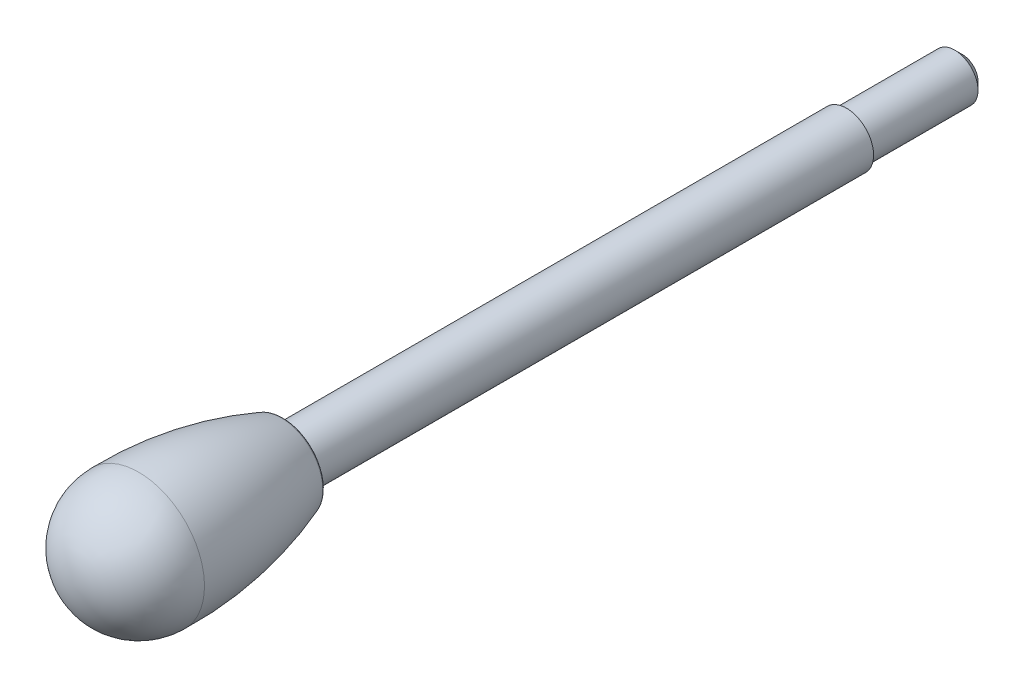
ISO-10303-21;
HEADER;
FILE_DESCRIPTION(('STEP AP214'),'2;1');
FILE_NAME('part.step','',(''),(''),'','','');
FILE_SCHEMA(('AUTOMOTIVE_DESIGN { 1 0 10303 214 1 1 1 1 }'));
ENDSEC;
DATA;
#1=APPLICATION_CONTEXT('core data for automotive mechanical design processes');
#2=APPLICATION_PROTOCOL_DEFINITION('international standard','automotive_design',2000,#1);
#3=PRODUCT_CONTEXT('',#1,'mechanical');
#4=PRODUCT('Part','Part','',(#3));
#5=PRODUCT_RELATED_PRODUCT_CATEGORY('part','',(#4));
#6=PRODUCT_DEFINITION_FORMATION('','',#4);
#7=PRODUCT_DEFINITION_CONTEXT('part definition',#1,'design');
#8=PRODUCT_DEFINITION('design','',#6,#7);
#9=PRODUCT_DEFINITION_SHAPE('','',#8);
#10=(LENGTH_UNIT() NAMED_UNIT(*) SI_UNIT(.MILLI.,.METRE.));
#11=(NAMED_UNIT(*) PLANE_ANGLE_UNIT() SI_UNIT($,.RADIAN.));
#12=(NAMED_UNIT(*) SI_UNIT($,.STERADIAN.) SOLID_ANGLE_UNIT());
#13=UNCERTAINTY_MEASURE_WITH_UNIT(LENGTH_MEASURE(1.E-05),#10,'distance_accuracy_value','');
#14=(GEOMETRIC_REPRESENTATION_CONTEXT(3) GLOBAL_UNCERTAINTY_ASSIGNED_CONTEXT((#13)) GLOBAL_UNIT_ASSIGNED_CONTEXT((#10,
#11,#12)) REPRESENTATION_CONTEXT('',''));
#15=CARTESIAN_POINT('',(0.,0.,0.));
#16=DIRECTION('',(0.,0.,1.));
#17=DIRECTION('',(1.,0.,0.));
#18=AXIS2_PLACEMENT_3D('',#15,#16,#17);
#19=CARTESIAN_POINT('',(0.,0.,183.));
#20=DIRECTION('',(0.,0.,-1.));
#21=DIRECTION('',(0.,-1.,0.));
#22=AXIS2_PLACEMENT_3D('',#19,#20,#21);
#23=SPHERICAL_SURFACE('',#22,17.);
#24=CARTESIAN_POINT('',(0.,0.,182.999999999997));
#25=DIRECTION('',(0.,0.,-1.));
#26=DIRECTION('',(0.,-1.,0.));
#27=AXIS2_PLACEMENT_3D('',#24,#25,#26);
#28=CIRCLE('',#27,17.);
#29=CARTESIAN_POINT('',(0.,-17.,182.999999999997));
#30=VERTEX_POINT('',#29);
#31=EDGE_CURVE('E8',#30,#30,#28,.T.);
#32=ORIENTED_EDGE('',*,*,#31,.F.);
#33=EDGE_LOOP('',(#32));
#34=FACE_BOUND('',#33,.T.);
#35=ADVANCED_FACE('F12',(#34),#23,.T.);
#36=CARTESIAN_POINT('',(0.,0.,181.103564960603));
#37=DIRECTION('',(0.,0.,-1.));
#38=DIRECTION('',(0.,-1.,0.));
#39=AXIS2_PLACEMENT_3D('',#36,#37,#38);
#40=DEGENERATE_TOROIDAL_SURFACE('',#39,83.4821055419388,100.5,.F.);
#41=CARTESIAN_POINT('',(0.,0.,146.152225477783));
#42=DIRECTION('',(0.,0.,-1.));
#43=DIRECTION('',(0.,-1.,0.));
#44=AXIS2_PLACEMENT_3D('',#41,#42,#43);
#45=CIRCLE('',#44,10.7445035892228);
#46=CARTESIAN_POINT('',(0.,-10.7445035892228,146.152225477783));
#47=VERTEX_POINT('',#46);
#48=EDGE_CURVE('E18',#47,#47,#45,.T.);
#49=ORIENTED_EDGE('',*,*,#48,.F.);
#50=EDGE_LOOP('',(#49));
#51=FACE_BOUND('',#50,.T.);
#52=ORIENTED_EDGE('',*,*,#31,.T.);
#53=EDGE_LOOP('',(#52));
#54=FACE_BOUND('',#53,.T.);
#55=ADVANCED_FACE('F78',(#51,#54),#40,.F.);
#56=CARTESIAN_POINT('',(0.,0.,146.5));
#57=DIRECTION('',(0.,0.,-1.));
#58=DIRECTION('',(0.,-1.,0.));
#59=AXIS2_PLACEMENT_3D('',#56,#57,#58);
#60=TOROIDAL_SURFACE('',#59,9.80692538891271,1.);
#61=CARTESIAN_POINT('',(0.,0.,145.5));
#62=DIRECTION('',(0.,0.,-1.));
#63=DIRECTION('',(0.,-1.,0.));
#64=AXIS2_PLACEMENT_3D('',#61,#62,#63);
#65=CIRCLE('',#64,9.80692538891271);
#66=CARTESIAN_POINT('',(0.,-9.80692538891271,145.5));
#67=VERTEX_POINT('',#66);
#68=EDGE_CURVE('E22',#67,#67,#65,.T.);
#69=ORIENTED_EDGE('',*,*,#68,.F.);
#70=EDGE_LOOP('',(#69));
#71=FACE_BOUND('',#70,.T.);
#72=ORIENTED_EDGE('',*,*,#48,.T.);
#73=EDGE_LOOP('',(#72));
#74=FACE_BOUND('',#73,.T.);
#75=ADVANCED_FACE('F73',(#71,#74),#60,.T.);
#76=CARTESIAN_POINT('',(0.,6.99999999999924,145.5));
#77=DIRECTION('',(0.,0.,1.));
#78=DIRECTION('',(0.,1.,0.));
#79=AXIS2_PLACEMENT_3D('',#76,#77,#78);
#80=PLANE('',#79);
#81=CARTESIAN_POINT('',(0.,0.,145.5));
#82=DIRECTION('',(0.,0.,-1.));
#83=DIRECTION('',(0.,-1.,0.));
#84=AXIS2_PLACEMENT_3D('',#81,#82,#83);
#85=CIRCLE('',#84,6.99999999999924);
#86=CARTESIAN_POINT('',(0.,-6.99999999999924,145.5));
#87=VERTEX_POINT('',#86);
#88=EDGE_CURVE('E26',#87,#87,#85,.T.);
#89=ORIENTED_EDGE('',*,*,#88,.F.);
#90=EDGE_LOOP('',(#89));
#91=FACE_BOUND('',#90,.T.);
#92=ORIENTED_EDGE('',*,*,#68,.T.);
#93=EDGE_LOOP('',(#92));
#94=FACE_BOUND('',#93,.T.);
#95=ADVANCED_FACE('F67',(#91,#94),#80,.F.);
#96=CARTESIAN_POINT('',(0.,0.,-35.));
#97=DIRECTION('',(0.,0.,-1.));
#98=DIRECTION('',(0.,-1.,0.));
#99=AXIS2_PLACEMENT_3D('',#96,#97,#98);
#100=CYLINDRICAL_SURFACE('',#99,6.99999999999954);
#101=CARTESIAN_POINT('',(0.,0.,0.));
#102=DIRECTION('',(0.,0.,-1.));
#103=DIRECTION('',(0.,-1.,0.));
#104=AXIS2_PLACEMENT_3D('',#101,#102,#103);
#105=CIRCLE('',#104,6.99999999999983);
#106=CARTESIAN_POINT('',(0.,-6.99999999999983,0.));
#107=VERTEX_POINT('',#106);
#108=EDGE_CURVE('E31',#107,#107,#105,.T.);
#109=ORIENTED_EDGE('',*,*,#108,.F.);
#110=EDGE_LOOP('',(#109));
#111=FACE_BOUND('',#110,.T.);
#112=ORIENTED_EDGE('',*,*,#88,.T.);
#113=EDGE_LOOP('',(#112));
#114=FACE_BOUND('',#113,.T.);
#115=ADVANCED_FACE('F61',(#111,#114),#100,.T.);
#116=CARTESIAN_POINT('',(0.,5.99999999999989,0.));
#117=DIRECTION('',(0.,0.,1.));
#118=DIRECTION('',(0.,1.,0.));
#119=AXIS2_PLACEMENT_3D('',#116,#117,#118);
#120=PLANE('',#119);
#121=CARTESIAN_POINT('',(0.,0.,0.));
#122=DIRECTION('',(0.,0.,-1.));
#123=DIRECTION('',(0.,-1.,0.));
#124=AXIS2_PLACEMENT_3D('',#121,#122,#123);
#125=CIRCLE('',#124,5.99999999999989);
#126=CARTESIAN_POINT('',(0.,-5.99999999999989,0.));
#127=VERTEX_POINT('',#126);
#128=EDGE_CURVE('E34',#127,#127,#125,.T.);
#129=ORIENTED_EDGE('',*,*,#128,.F.);
#130=EDGE_LOOP('',(#129));
#131=FACE_BOUND('',#130,.T.);
#132=ORIENTED_EDGE('',*,*,#108,.T.);
#133=EDGE_LOOP('',(#132));
#134=FACE_BOUND('',#133,.T.);
#135=ADVANCED_FACE('F55',(#131,#134),#120,.F.);
#136=CARTESIAN_POINT('',(0.,0.,-35.));
#137=DIRECTION('',(0.,0.,-1.));
#138=DIRECTION('',(0.,-1.,0.));
#139=AXIS2_PLACEMENT_3D('',#136,#137,#138);
#140=CYLINDRICAL_SURFACE('',#139,6.);
#141=CARTESIAN_POINT('',(0.,0.,-28.));
#142=DIRECTION('',(0.,0.,-1.));
#143=DIRECTION('',(0.,-1.,0.));
#144=AXIS2_PLACEMENT_3D('',#141,#142,#143);
#145=CIRCLE('',#144,6.);
#146=CARTESIAN_POINT('',(0.,-6.,-28.));
#147=VERTEX_POINT('',#146);
#148=EDGE_CURVE('E37',#147,#147,#145,.T.);
#149=ORIENTED_EDGE('',*,*,#148,.F.);
#150=EDGE_LOOP('',(#149));
#151=FACE_BOUND('',#150,.T.);
#152=ORIENTED_EDGE('',*,*,#128,.T.);
#153=EDGE_LOOP('',(#152));
#154=FACE_BOUND('',#153,.T.);
#155=ADVANCED_FACE('F49',(#151,#154),#140,.T.);
#156=CARTESIAN_POINT('',(0.,0.,-28.));
#157=DIRECTION('',(0.,0.,1.));
#158=DIRECTION('',(0.,1.,0.));
#159=AXIS2_PLACEMENT_3D('',#156,#157,#158);
#160=CONICAL_SURFACE('',#159,6.,0.785398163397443);
#161=CARTESIAN_POINT('',(0.,0.,-30.));
#162=DIRECTION('',(0.,0.,-1.));
#163=DIRECTION('',(0.,-1.,0.));
#164=AXIS2_PLACEMENT_3D('',#161,#162,#163);
#165=CIRCLE('',#164,4.);
#166=CARTESIAN_POINT('',(0.,-4.,-30.));
#167=VERTEX_POINT('',#166);
#168=EDGE_CURVE('E40',#167,#167,#165,.T.);
#169=ORIENTED_EDGE('',*,*,#168,.F.);
#170=EDGE_LOOP('',(#169));
#171=FACE_BOUND('',#170,.T.);
#172=ORIENTED_EDGE('',*,*,#148,.T.);
#173=EDGE_LOOP('',(#172));
#174=FACE_BOUND('',#173,.T.);
#175=ADVANCED_FACE('F46',(#171,#174),#160,.T.);
#176=CARTESIAN_POINT('',(0.,0.,-30.));
#177=DIRECTION('',(0.,0.,1.));
#178=DIRECTION('',(0.,1.,0.));
#179=AXIS2_PLACEMENT_3D('',#176,#177,#178);
#180=PLANE('',#179);
#181=ORIENTED_EDGE('',*,*,#168,.T.);
#182=EDGE_LOOP('',(#181));
#183=FACE_BOUND('',#182,.T.);
#184=ADVANCED_FACE('F44',(#183),#180,.F.);
#185=CLOSED_SHELL('',(#35,#55,#75,#95,#115,#135,#155,#175,#184));
#186=MANIFOLD_SOLID_BREP('B1',#185);
#187=ADVANCED_BREP_SHAPE_REPRESENTATION('',(#18,#186),#14);
#188=SHAPE_DEFINITION_REPRESENTATION(#9,#187);
ENDSEC;
END-ISO-10303-21;
